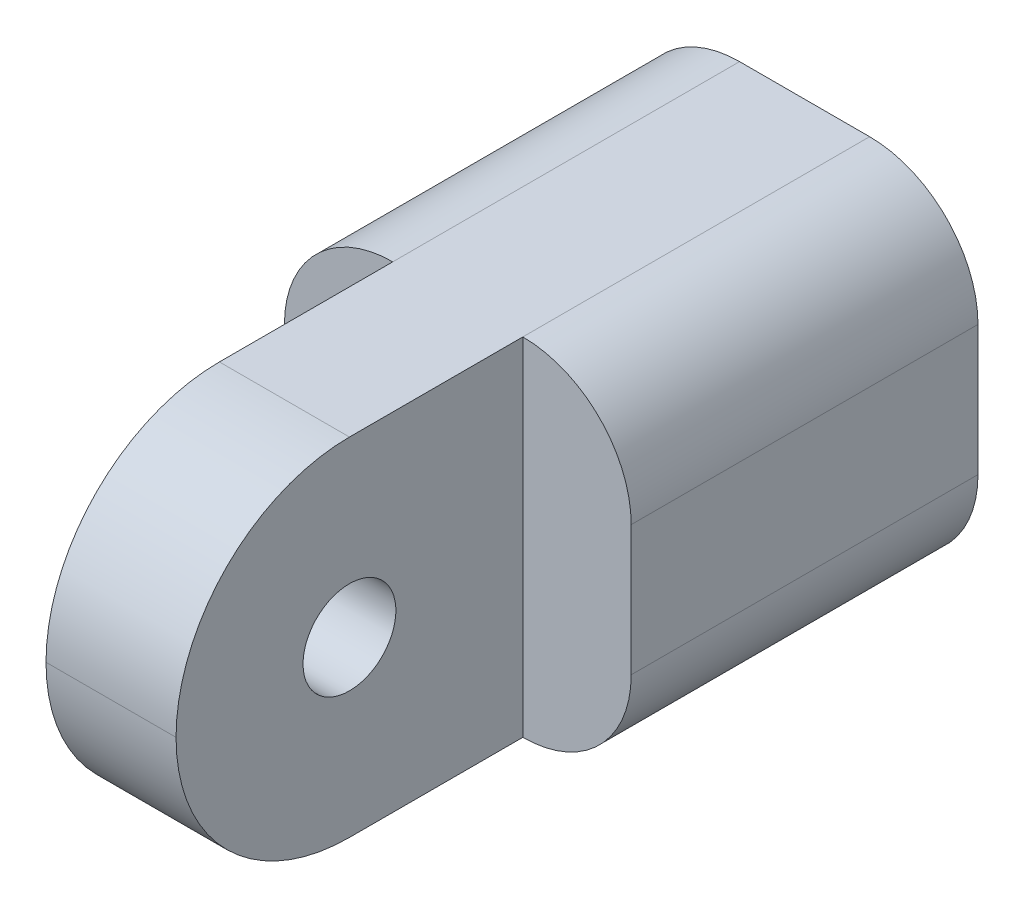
ISO-10303-21;
HEADER;
FILE_DESCRIPTION(('STEP AP214'),'2;1');
FILE_NAME('part.step','',(''),(''),'','','');
FILE_SCHEMA(('AUTOMOTIVE_DESIGN { 1 0 10303 214 1 1 1 1 }'));
ENDSEC;
DATA;
#1=APPLICATION_CONTEXT('core data for automotive mechanical design processes');
#2=APPLICATION_PROTOCOL_DEFINITION('international standard','automotive_design',2000,#1);
#3=PRODUCT_CONTEXT('',#1,'mechanical');
#4=PRODUCT('Part','Part','',(#3));
#5=PRODUCT_RELATED_PRODUCT_CATEGORY('part','',(#4));
#6=PRODUCT_DEFINITION_FORMATION('','',#4);
#7=PRODUCT_DEFINITION_CONTEXT('part definition',#1,'design');
#8=PRODUCT_DEFINITION('design','',#6,#7);
#9=PRODUCT_DEFINITION_SHAPE('','',#8);
#10=(LENGTH_UNIT() NAMED_UNIT(*) SI_UNIT(.MILLI.,.METRE.));
#11=(NAMED_UNIT(*) PLANE_ANGLE_UNIT() SI_UNIT($,.RADIAN.));
#12=(NAMED_UNIT(*) SI_UNIT($,.STERADIAN.) SOLID_ANGLE_UNIT());
#13=UNCERTAINTY_MEASURE_WITH_UNIT(LENGTH_MEASURE(1.E-05),#10,'distance_accuracy_value','');
#14=(GEOMETRIC_REPRESENTATION_CONTEXT(3) GLOBAL_UNCERTAINTY_ASSIGNED_CONTEXT((#13)) GLOBAL_UNIT_ASSIGNED_CONTEXT((#10,
#11,#12)) REPRESENTATION_CONTEXT('',''));
#15=CARTESIAN_POINT('',(0.,0.,0.));
#16=DIRECTION('',(0.,0.,1.));
#17=DIRECTION('',(1.,0.,0.));
#18=AXIS2_PLACEMENT_3D('',#15,#16,#17);
#19=CARTESIAN_POINT('',(-6.35,6.35,25.4));
#20=DIRECTION('',(1.,0.,0.));
#21=DIRECTION('',(0.,1.,0.));
#22=AXIS2_PLACEMENT_3D('',#19,#20,#21);
#23=PLANE('',#22);
#24=DIRECTION('',(0.,0.,-1.));
#25=VECTOR('',#24,1.);
#26=CARTESIAN_POINT('',(-6.35,-2.38125,25.4));
#27=LINE('',#26,#25);
#28=CARTESIAN_POINT('',(-6.35,-2.38125,0.));
#29=VERTEX_POINT('',#28);
#30=CARTESIAN_POINT('',(-6.35,-2.38125,12.7));
#31=VERTEX_POINT('',#30);
#32=EDGE_CURVE('E158',#29,#31,#27,.F.);
#33=ORIENTED_EDGE('',*,*,#32,.T.);
#34=DIRECTION('',(0.,1.,0.));
#35=VECTOR('',#34,1.);
#36=CARTESIAN_POINT('',(-6.35,-6.35,12.7));
#37=LINE('',#36,#35);
#38=CARTESIAN_POINT('',(-6.35,2.38125,12.7));
#39=VERTEX_POINT('',#38);
#40=EDGE_CURVE('E135',#31,#39,#37,.T.);
#41=ORIENTED_EDGE('',*,*,#40,.T.);
#42=DIRECTION('',(0.,0.,-1.));
#43=VECTOR('',#42,1.);
#44=CARTESIAN_POINT('',(-6.35,2.38125,25.4));
#45=LINE('',#44,#43);
#46=CARTESIAN_POINT('',(-6.35,2.38125,0.));
#47=VERTEX_POINT('',#46);
#48=EDGE_CURVE('E156',#39,#47,#45,.T.);
#49=ORIENTED_EDGE('',*,*,#48,.T.);
#50=DIRECTION('',(0.,-1.,0.));
#51=VECTOR('',#50,1.);
#52=CARTESIAN_POINT('',(-6.35,6.35,0.));
#53=LINE('',#52,#51);
#54=EDGE_CURVE('E212',#47,#29,#53,.T.);
#55=ORIENTED_EDGE('',*,*,#54,.T.);
#56=EDGE_LOOP('',(#33,#41,#49,#55));
#57=FACE_BOUND('',#56,.T.);
#58=ADVANCED_FACE('F33',(#57),#23,.F.);
#59=CARTESIAN_POINT('',(-6.35,-6.35,25.4));
#60=DIRECTION('',(0.,1.,0.));
#61=DIRECTION('',(0.,0.,1.));
#62=AXIS2_PLACEMENT_3D('',#59,#60,#61);
#63=PLANE('',#62);
#64=DIRECTION('',(0.,0.,1.));
#65=VECTOR('',#64,1.);
#66=CARTESIAN_POINT('',(2.38125,-6.35,25.4));
#67=LINE('',#66,#65);
#68=CARTESIAN_POINT('',(2.38125,-6.35,12.7));
#69=VERTEX_POINT('',#68);
#70=CARTESIAN_POINT('',(2.38125,-6.35,19.05));
#71=VERTEX_POINT('',#70);
#72=EDGE_CURVE('E182',#69,#71,#67,.T.);
#73=ORIENTED_EDGE('',*,*,#72,.T.);
#74=DIRECTION('',(1.,0.,0.));
#75=VECTOR('',#74,1.);
#76=CARTESIAN_POINT('',(-2.38125,-6.35,19.05));
#77=LINE('',#76,#75);
#78=CARTESIAN_POINT('',(-2.38125,-6.35,19.05));
#79=VERTEX_POINT('',#78);
#80=EDGE_CURVE('E125',#71,#79,#77,.F.);
#81=ORIENTED_EDGE('',*,*,#80,.T.);
#82=DIRECTION('',(0.,0.,-1.));
#83=VECTOR('',#82,1.);
#84=CARTESIAN_POINT('',(-2.38125,-6.35,25.4));
#85=LINE('',#84,#83);
#86=CARTESIAN_POINT('',(-2.38125,-6.35,12.7));
#87=VERTEX_POINT('',#86);
#88=EDGE_CURVE('E116',#79,#87,#85,.T.);
#89=ORIENTED_EDGE('',*,*,#88,.T.);
#90=CARTESIAN_POINT('',(-2.38125,-6.35,0.));
#91=VERTEX_POINT('',#90);
#92=EDGE_CURVE('E122',#87,#91,#85,.T.);
#93=ORIENTED_EDGE('',*,*,#92,.T.);
#94=DIRECTION('',(1.,0.,0.));
#95=VECTOR('',#94,1.);
#96=CARTESIAN_POINT('',(-6.35,-6.35,0.));
#97=LINE('',#96,#95);
#98=CARTESIAN_POINT('',(2.38125,-6.35,0.));
#99=VERTEX_POINT('',#98);
#100=EDGE_CURVE('E215',#91,#99,#97,.T.);
#101=ORIENTED_EDGE('',*,*,#100,.T.);
#102=DIRECTION('',(0.,0.,-1.));
#103=VECTOR('',#102,1.);
#104=CARTESIAN_POINT('',(2.38125,-6.35,25.4));
#105=LINE('',#104,#103);
#106=EDGE_CURVE('E127',#99,#69,#105,.F.);
#107=ORIENTED_EDGE('',*,*,#106,.T.);
#108=EDGE_LOOP('',(#73,#81,#89,#93,#101,#107));
#109=FACE_BOUND('',#108,.T.);
#110=ADVANCED_FACE('F119',(#109),#63,.F.);
#111=CARTESIAN_POINT('',(6.35,6.35,25.4));
#112=DIRECTION('',(-1.,0.,0.));
#113=DIRECTION('',(0.,-1.,0.));
#114=AXIS2_PLACEMENT_3D('',#111,#112,#113);
#115=PLANE('',#114);
#116=DIRECTION('',(0.,0.,-1.));
#117=VECTOR('',#116,1.);
#118=CARTESIAN_POINT('',(6.35,2.38125,25.4));
#119=LINE('',#118,#117);
#120=CARTESIAN_POINT('',(6.35,2.38125,0.));
#121=VERTEX_POINT('',#120);
#122=CARTESIAN_POINT('',(6.35,2.38125,12.7));
#123=VERTEX_POINT('',#122);
#124=EDGE_CURVE('E223',#121,#123,#119,.F.);
#125=ORIENTED_EDGE('',*,*,#124,.T.);
#126=DIRECTION('',(0.,1.,0.));
#127=VECTOR('',#126,1.);
#128=CARTESIAN_POINT('',(6.35,-6.35,12.7));
#129=LINE('',#128,#127);
#130=CARTESIAN_POINT('',(6.35,-2.38125,12.7));
#131=VERTEX_POINT('',#130);
#132=EDGE_CURVE('E190',#131,#123,#129,.T.);
#133=ORIENTED_EDGE('',*,*,#132,.F.);
#134=DIRECTION('',(0.,0.,-1.));
#135=VECTOR('',#134,1.);
#136=CARTESIAN_POINT('',(6.35,-2.38125,25.4));
#137=LINE('',#136,#135);
#138=CARTESIAN_POINT('',(6.35,-2.38125,0.));
#139=VERTEX_POINT('',#138);
#140=EDGE_CURVE('E226',#131,#139,#137,.T.);
#141=ORIENTED_EDGE('',*,*,#140,.T.);
#142=DIRECTION('',(0.,1.,0.));
#143=VECTOR('',#142,1.);
#144=CARTESIAN_POINT('',(6.35,6.35,0.));
#145=LINE('',#144,#143);
#146=EDGE_CURVE('E217',#139,#121,#145,.T.);
#147=ORIENTED_EDGE('',*,*,#146,.T.);
#148=EDGE_LOOP('',(#125,#133,#141,#147));
#149=FACE_BOUND('',#148,.T.);
#150=ADVANCED_FACE('F251',(#149),#115,.F.);
#151=CARTESIAN_POINT('',(-6.35,6.35,25.4));
#152=DIRECTION('',(0.,-1.,0.));
#153=DIRECTION('',(0.,0.,-1.));
#154=AXIS2_PLACEMENT_3D('',#151,#152,#153);
#155=PLANE('',#154);
#156=DIRECTION('',(0.,0.,-1.));
#157=VECTOR('',#156,1.);
#158=CARTESIAN_POINT('',(-2.38125,6.35,25.4));
#159=LINE('',#158,#157);
#160=CARTESIAN_POINT('',(-2.38125,6.35,12.7));
#161=VERTEX_POINT('',#160);
#162=CARTESIAN_POINT('',(-2.38125,6.35,19.05));
#163=VERTEX_POINT('',#162);
#164=EDGE_CURVE('E143',#161,#163,#159,.F.);
#165=ORIENTED_EDGE('',*,*,#164,.T.);
#166=DIRECTION('',(-1.,0.,0.));
#167=VECTOR('',#166,1.);
#168=CARTESIAN_POINT('',(2.38125,6.35,19.05));
#169=LINE('',#168,#167);
#170=CARTESIAN_POINT('',(2.38125,6.35,19.05));
#171=VERTEX_POINT('',#170);
#172=EDGE_CURVE('E11',#163,#171,#169,.F.);
#173=ORIENTED_EDGE('',*,*,#172,.T.);
#174=DIRECTION('',(0.,0.,-1.));
#175=VECTOR('',#174,1.);
#176=CARTESIAN_POINT('',(2.38125,6.35,25.4));
#177=LINE('',#176,#175);
#178=CARTESIAN_POINT('',(2.38125,6.35,12.7));
#179=VERTEX_POINT('',#178);
#180=EDGE_CURVE('E161',#171,#179,#177,.T.);
#181=ORIENTED_EDGE('',*,*,#180,.T.);
#182=CARTESIAN_POINT('',(2.38125,6.35,0.));
#183=VERTEX_POINT('',#182);
#184=EDGE_CURVE('E160',#179,#183,#177,.T.);
#185=ORIENTED_EDGE('',*,*,#184,.T.);
#186=DIRECTION('',(-1.,0.,0.));
#187=VECTOR('',#186,1.);
#188=CARTESIAN_POINT('',(-6.35,6.35,0.));
#189=LINE('',#188,#187);
#190=CARTESIAN_POINT('',(-2.38125,6.35,0.));
#191=VERTEX_POINT('',#190);
#192=EDGE_CURVE('E220',#183,#191,#189,.T.);
#193=ORIENTED_EDGE('',*,*,#192,.T.);
#194=EDGE_CURVE('E163',#191,#161,#159,.F.);
#195=ORIENTED_EDGE('',*,*,#194,.T.);
#196=EDGE_LOOP('',(#165,#173,#181,#185,#193,#195));
#197=FACE_BOUND('',#196,.T.);
#198=ADVANCED_FACE('F243',(#197),#155,.F.);
#199=CARTESIAN_POINT('',(0.,0.,0.));
#200=DIRECTION('',(0.,0.,1.));
#201=DIRECTION('',(1.,0.,0.));
#202=AXIS2_PLACEMENT_3D('',#199,#200,#201);
#203=PLANE('',#202);
#204=CARTESIAN_POINT('',(0.,0.,0.));
#205=DIRECTION('',(0.,0.,-1.));
#206=DIRECTION('',(-1.,0.,0.));
#207=AXIS2_PLACEMENT_3D('',#204,#205,#206);
#208=CIRCLE('',#207,3.39999999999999);
#209=CARTESIAN_POINT('',(-3.39999999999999,0.,0.));
#210=VERTEX_POINT('',#209);
#211=EDGE_CURVE('E139',#210,#210,#208,.T.);
#212=ORIENTED_EDGE('',*,*,#211,.F.);
#213=EDGE_LOOP('',(#212));
#214=FACE_BOUND('',#213,.T.);
#215=ORIENTED_EDGE('',*,*,#146,.F.);
#216=CARTESIAN_POINT('',(2.38125,-2.38125,0.));
#217=DIRECTION('',(0.,0.,1.));
#218=DIRECTION('',(1.,0.,0.));
#219=AXIS2_PLACEMENT_3D('',#216,#217,#218);
#220=CIRCLE('',#219,3.96875);
#221=EDGE_CURVE('E150',#139,#99,#220,.F.);
#222=ORIENTED_EDGE('',*,*,#221,.T.);
#223=ORIENTED_EDGE('',*,*,#100,.F.);
#224=CARTESIAN_POINT('',(-2.38125,-2.38125,0.));
#225=DIRECTION('',(0.,0.,1.));
#226=DIRECTION('',(1.,0.,0.));
#227=AXIS2_PLACEMENT_3D('',#224,#225,#226);
#228=CIRCLE('',#227,3.96875);
#229=EDGE_CURVE('E148',#91,#29,#228,.F.);
#230=ORIENTED_EDGE('',*,*,#229,.T.);
#231=ORIENTED_EDGE('',*,*,#54,.F.);
#232=CARTESIAN_POINT('',(-2.38125,2.38125,0.));
#233=DIRECTION('',(0.,0.,1.));
#234=DIRECTION('',(1.,0.,0.));
#235=AXIS2_PLACEMENT_3D('',#232,#233,#234);
#236=CIRCLE('',#235,3.96875);
#237=EDGE_CURVE('E230',#47,#191,#236,.F.);
#238=ORIENTED_EDGE('',*,*,#237,.T.);
#239=ORIENTED_EDGE('',*,*,#192,.F.);
#240=CARTESIAN_POINT('',(2.38125,2.38125,0.));
#241=DIRECTION('',(0.,0.,1.));
#242=DIRECTION('',(1.,0.,0.));
#243=AXIS2_PLACEMENT_3D('',#240,#241,#242);
#244=CIRCLE('',#243,3.96875);
#245=EDGE_CURVE('E228',#183,#121,#244,.F.);
#246=ORIENTED_EDGE('',*,*,#245,.T.);
#247=EDGE_LOOP('',(#215,#222,#223,#230,#231,#238,#239,#246));
#248=FACE_BOUND('',#247,.T.);
#249=ADVANCED_FACE('F234',(#214,#248),#203,.F.);
#250=CARTESIAN_POINT('',(2.38125,-2.38125,25.4));
#251=DIRECTION('',(0.,0.,-1.));
#252=DIRECTION('',(-1.,0.,0.));
#253=AXIS2_PLACEMENT_3D('',#250,#251,#252);
#254=CYLINDRICAL_SURFACE('',#253,3.96875);
#255=CARTESIAN_POINT('',(2.38125,-2.38125,12.7));
#256=DIRECTION('',(0.,0.,-1.));
#257=DIRECTION('',(-1.,0.,0.));
#258=AXIS2_PLACEMENT_3D('',#255,#256,#257);
#259=CIRCLE('',#258,3.96875);
#260=EDGE_CURVE('E140',#69,#131,#259,.F.);
#261=ORIENTED_EDGE('',*,*,#260,.F.);
#262=ORIENTED_EDGE('',*,*,#106,.F.);
#263=ORIENTED_EDGE('',*,*,#221,.F.);
#264=ORIENTED_EDGE('',*,*,#140,.F.);
#265=EDGE_LOOP('',(#261,#262,#263,#264));
#266=FACE_BOUND('',#265,.T.);
#267=ADVANCED_FACE('F256',(#266),#254,.T.);
#268=CARTESIAN_POINT('',(-2.38125,-2.38125,25.4));
#269=DIRECTION('',(0.,0.,-1.));
#270=DIRECTION('',(-1.,0.,0.));
#271=AXIS2_PLACEMENT_3D('',#268,#269,#270);
#272=CYLINDRICAL_SURFACE('',#271,3.96875);
#273=CARTESIAN_POINT('',(-2.38125,-2.38125,12.7));
#274=DIRECTION('',(0.,0.,-1.));
#275=DIRECTION('',(-1.,0.,0.));
#276=AXIS2_PLACEMENT_3D('',#273,#274,#275);
#277=CIRCLE('',#276,3.96875);
#278=EDGE_CURVE('E131',#31,#87,#277,.F.);
#279=ORIENTED_EDGE('',*,*,#278,.F.);
#280=ORIENTED_EDGE('',*,*,#32,.F.);
#281=ORIENTED_EDGE('',*,*,#229,.F.);
#282=ORIENTED_EDGE('',*,*,#92,.F.);
#283=EDGE_LOOP('',(#279,#280,#281,#282));
#284=FACE_BOUND('',#283,.T.);
#285=ADVANCED_FACE('F147',(#284),#272,.T.);
#286=CARTESIAN_POINT('',(-2.38125,2.38125,25.4));
#287=DIRECTION('',(0.,0.,-1.));
#288=DIRECTION('',(-1.,0.,0.));
#289=AXIS2_PLACEMENT_3D('',#286,#287,#288);
#290=CYLINDRICAL_SURFACE('',#289,3.96875);
#291=CARTESIAN_POINT('',(-2.38125,2.38125,12.7));
#292=DIRECTION('',(0.,0.,-1.));
#293=DIRECTION('',(-1.,0.,0.));
#294=AXIS2_PLACEMENT_3D('',#291,#292,#293);
#295=CIRCLE('',#294,3.96875);
#296=EDGE_CURVE('E169',#161,#39,#295,.F.);
#297=ORIENTED_EDGE('',*,*,#296,.F.);
#298=ORIENTED_EDGE('',*,*,#194,.F.);
#299=ORIENTED_EDGE('',*,*,#237,.F.);
#300=ORIENTED_EDGE('',*,*,#48,.F.);
#301=EDGE_LOOP('',(#297,#298,#299,#300));
#302=FACE_BOUND('',#301,.T.);
#303=ADVANCED_FACE('F240',(#302),#290,.T.);
#304=CARTESIAN_POINT('',(2.38125,2.38125,25.4));
#305=DIRECTION('',(0.,0.,-1.));
#306=DIRECTION('',(-1.,0.,0.));
#307=AXIS2_PLACEMENT_3D('',#304,#305,#306);
#308=CYLINDRICAL_SURFACE('',#307,3.96875);
#309=CARTESIAN_POINT('',(2.38125,2.38125,12.7));
#310=DIRECTION('',(0.,0.,-1.));
#311=DIRECTION('',(-1.,0.,0.));
#312=AXIS2_PLACEMENT_3D('',#309,#310,#311);
#313=CIRCLE('',#312,3.96875);
#314=EDGE_CURVE('E166',#123,#179,#313,.F.);
#315=ORIENTED_EDGE('',*,*,#314,.F.);
#316=ORIENTED_EDGE('',*,*,#124,.F.);
#317=ORIENTED_EDGE('',*,*,#245,.F.);
#318=ORIENTED_EDGE('',*,*,#184,.F.);
#319=EDGE_LOOP('',(#315,#316,#317,#318));
#320=FACE_BOUND('',#319,.T.);
#321=ADVANCED_FACE('F249',(#320),#308,.T.);
#322=CARTESIAN_POINT('',(0.,0.,10.));
#323=DIRECTION('',(0.,0.,-1.));
#324=DIRECTION('',(-1.,0.,0.));
#325=AXIS2_PLACEMENT_3D('',#322,#323,#324);
#326=CONICAL_SURFACE('',#325,3.4,1.02974425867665);
#327=CARTESIAN_POINT('',(0.,0.,12.0429261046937));
#328=VERTEX_POINT('',#327);
#329=VERTEX_LOOP('',#328);
#330=FACE_BOUND('',#329,.T.);
#331=CARTESIAN_POINT('',(0.,0.,10.));
#332=DIRECTION('',(0.,0.,-1.));
#333=DIRECTION('',(-1.,0.,0.));
#334=AXIS2_PLACEMENT_3D('',#331,#332,#333);
#335=CIRCLE('',#334,3.4);
#336=CARTESIAN_POINT('',(-3.4,0.,10.));
#337=VERTEX_POINT('',#336);
#338=EDGE_CURVE('E209',#337,#337,#335,.T.);
#339=ORIENTED_EDGE('',*,*,#338,.T.);
#340=EDGE_LOOP('',(#339));
#341=FACE_BOUND('',#340,.T.);
#342=ADVANCED_FACE('F282',(#330,#341),#326,.F.);
#343=CARTESIAN_POINT('',(0.,0.,0.));
#344=DIRECTION('',(0.,0.,-1.));
#345=DIRECTION('',(-1.,0.,0.));
#346=AXIS2_PLACEMENT_3D('',#343,#344,#345);
#347=CYLINDRICAL_SURFACE('',#346,3.39999999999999);
#348=ORIENTED_EDGE('',*,*,#338,.F.);
#349=EDGE_LOOP('',(#348));
#350=FACE_BOUND('',#349,.T.);
#351=ORIENTED_EDGE('',*,*,#211,.T.);
#352=EDGE_LOOP('',(#351));
#353=FACE_BOUND('',#352,.T.);
#354=ADVANCED_FACE('F286',(#350,#353),#347,.F.);
#355=CARTESIAN_POINT('',(2.38125,-6.35,25.4));
#356=DIRECTION('',(-1.,0.,0.));
#357=DIRECTION('',(0.,0.,1.));
#358=AXIS2_PLACEMENT_3D('',#355,#356,#357);
#359=PLANE('',#358);
#360=CARTESIAN_POINT('',(2.38125,0.,19.05));
#361=DIRECTION('',(-1.,0.,0.));
#362=DIRECTION('',(0.,0.,1.));
#363=AXIS2_PLACEMENT_3D('',#360,#361,#362);
#364=CIRCLE('',#363,1.69999999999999);
#365=CARTESIAN_POINT('',(2.38125,0.,20.75));
#366=VERTEX_POINT('',#365);
#367=EDGE_CURVE('E194',#366,#366,#364,.T.);
#368=ORIENTED_EDGE('',*,*,#367,.T.);
#369=EDGE_LOOP('',(#368));
#370=FACE_BOUND('',#369,.T.);
#371=CARTESIAN_POINT('',(2.38125,0.,19.05));
#372=DIRECTION('',(-1.,0.,0.));
#373=DIRECTION('',(0.,0.,1.));
#374=AXIS2_PLACEMENT_3D('',#371,#372,#373);
#375=CIRCLE('',#374,6.35);
#376=CARTESIAN_POINT('',(2.38125,0.,25.4));
#377=VERTEX_POINT('',#376);
#378=EDGE_CURVE('E171',#171,#377,#375,.F.);
#379=ORIENTED_EDGE('',*,*,#378,.T.);
#380=CARTESIAN_POINT('',(2.38125,0.,19.05));
#381=DIRECTION('',(-1.,0.,0.));
#382=DIRECTION('',(0.,0.,1.));
#383=AXIS2_PLACEMENT_3D('',#380,#381,#382);
#384=CIRCLE('',#383,6.35);
#385=EDGE_CURVE('E173',#377,#71,#384,.F.);
#386=ORIENTED_EDGE('',*,*,#385,.T.);
#387=ORIENTED_EDGE('',*,*,#72,.F.);
#388=DIRECTION('',(0.,1.,0.));
#389=VECTOR('',#388,1.);
#390=CARTESIAN_POINT('',(2.38125,-6.35,12.7));
#391=LINE('',#390,#389);
#392=EDGE_CURVE('E145',#69,#179,#391,.T.);
#393=ORIENTED_EDGE('',*,*,#392,.T.);
#394=ORIENTED_EDGE('',*,*,#180,.F.);
#395=EDGE_LOOP('',(#379,#386,#387,#393,#394));
#396=FACE_BOUND('',#395,.T.);
#397=ADVANCED_FACE('F180',(#370,#396),#359,.F.);
#398=CARTESIAN_POINT('',(2.38125,-6.35,12.7));
#399=DIRECTION('',(0.,0.,-1.));
#400=DIRECTION('',(-1.,0.,0.));
#401=AXIS2_PLACEMENT_3D('',#398,#399,#400);
#402=PLANE('',#401);
#403=ORIENTED_EDGE('',*,*,#260,.T.);
#404=ORIENTED_EDGE('',*,*,#132,.T.);
#405=ORIENTED_EDGE('',*,*,#314,.T.);
#406=ORIENTED_EDGE('',*,*,#392,.F.);
#407=EDGE_LOOP('',(#403,#404,#405,#406));
#408=FACE_BOUND('',#407,.T.);
#409=ADVANCED_FACE('F258',(#408),#402,.F.);
#410=CARTESIAN_POINT('',(-2.38125,-6.35,25.4));
#411=DIRECTION('',(1.,0.,0.));
#412=DIRECTION('',(0.,0.,-1.));
#413=AXIS2_PLACEMENT_3D('',#410,#411,#412);
#414=PLANE('',#413);
#415=CARTESIAN_POINT('',(-2.38125,0.,19.05));
#416=DIRECTION('',(-1.,0.,0.));
#417=DIRECTION('',(0.,0.,1.));
#418=AXIS2_PLACEMENT_3D('',#415,#416,#417);
#419=CIRCLE('',#418,1.69999999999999);
#420=CARTESIAN_POINT('',(-2.38125,0.,20.75));
#421=VERTEX_POINT('',#420);
#422=EDGE_CURVE('E196',#421,#421,#419,.T.);
#423=ORIENTED_EDGE('',*,*,#422,.F.);
#424=EDGE_LOOP('',(#423));
#425=FACE_BOUND('',#424,.T.);
#426=ORIENTED_EDGE('',*,*,#88,.F.);
#427=CARTESIAN_POINT('',(-2.38125,0.,19.05));
#428=DIRECTION('',(1.,0.,0.));
#429=DIRECTION('',(0.,0.,-1.));
#430=AXIS2_PLACEMENT_3D('',#427,#428,#429);
#431=CIRCLE('',#430,6.35);
#432=CARTESIAN_POINT('',(-2.38125,0.,25.4));
#433=VERTEX_POINT('',#432);
#434=EDGE_CURVE('E42',#79,#433,#431,.F.);
#435=ORIENTED_EDGE('',*,*,#434,.T.);
#436=CARTESIAN_POINT('',(-2.38125,0.,19.05));
#437=DIRECTION('',(1.,0.,0.));
#438=DIRECTION('',(0.,0.,-1.));
#439=AXIS2_PLACEMENT_3D('',#436,#437,#438);
#440=CIRCLE('',#439,6.35);
#441=EDGE_CURVE('E52',#433,#163,#440,.F.);
#442=ORIENTED_EDGE('',*,*,#441,.T.);
#443=ORIENTED_EDGE('',*,*,#164,.F.);
#444=DIRECTION('',(0.,1.,0.));
#445=VECTOR('',#444,1.);
#446=CARTESIAN_POINT('',(-2.38125,-6.35,12.7));
#447=LINE('',#446,#445);
#448=EDGE_CURVE('E133',#87,#161,#447,.T.);
#449=ORIENTED_EDGE('',*,*,#448,.F.);
#450=EDGE_LOOP('',(#426,#435,#442,#443,#449));
#451=FACE_BOUND('',#450,.T.);
#452=ADVANCED_FACE('F142',(#425,#451),#414,.F.);
#453=CARTESIAN_POINT('',(-2.38125,-6.35,12.7));
#454=DIRECTION('',(0.,0.,-1.));
#455=DIRECTION('',(-1.,0.,0.));
#456=AXIS2_PLACEMENT_3D('',#453,#454,#455);
#457=PLANE('',#456);
#458=ORIENTED_EDGE('',*,*,#278,.T.);
#459=ORIENTED_EDGE('',*,*,#448,.T.);
#460=ORIENTED_EDGE('',*,*,#296,.T.);
#461=ORIENTED_EDGE('',*,*,#40,.F.);
#462=EDGE_LOOP('',(#458,#459,#460,#461));
#463=FACE_BOUND('',#462,.T.);
#464=ADVANCED_FACE('F132',(#463),#457,.F.);
#465=CARTESIAN_POINT('',(0.,0.,19.05));
#466=DIRECTION('',(1.,0.,0.));
#467=DIRECTION('',(0.,0.,-1.));
#468=AXIS2_PLACEMENT_3D('',#465,#466,#467);
#469=CYLINDRICAL_SURFACE('',#468,6.35);
#470=ORIENTED_EDGE('',*,*,#172,.F.);
#471=ORIENTED_EDGE('',*,*,#441,.F.);
#472=DIRECTION('',(-1.,0.,0.));
#473=VECTOR('',#472,1.);
#474=CARTESIAN_POINT('',(-2.38125,0.,25.4));
#475=LINE('',#474,#473);
#476=EDGE_CURVE('E37',#377,#433,#475,.T.);
#477=ORIENTED_EDGE('',*,*,#476,.F.);
#478=ORIENTED_EDGE('',*,*,#378,.F.);
#479=EDGE_LOOP('',(#470,#471,#477,#478));
#480=FACE_BOUND('',#479,.T.);
#481=ADVANCED_FACE('F35',(#480),#469,.T.);
#482=CARTESIAN_POINT('',(0.,0.,19.05));
#483=DIRECTION('',(-1.,0.,0.));
#484=DIRECTION('',(0.,0.,1.));
#485=AXIS2_PLACEMENT_3D('',#482,#483,#484);
#486=CYLINDRICAL_SURFACE('',#485,6.35);
#487=ORIENTED_EDGE('',*,*,#434,.F.);
#488=ORIENTED_EDGE('',*,*,#80,.F.);
#489=ORIENTED_EDGE('',*,*,#385,.F.);
#490=ORIENTED_EDGE('',*,*,#476,.T.);
#491=EDGE_LOOP('',(#487,#488,#489,#490));
#492=FACE_BOUND('',#491,.T.);
#493=ADVANCED_FACE('F192',(#492),#486,.T.);
#494=CARTESIAN_POINT('',(-2.38125,0.,19.05));
#495=DIRECTION('',(-1.,0.,0.));
#496=DIRECTION('',(0.,0.,1.));
#497=AXIS2_PLACEMENT_3D('',#494,#495,#496);
#498=CYLINDRICAL_SURFACE('',#497,1.69999999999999);
#499=ORIENTED_EDGE('',*,*,#422,.T.);
#500=EDGE_LOOP('',(#499));
#501=FACE_BOUND('',#500,.T.);
#502=ORIENTED_EDGE('',*,*,#367,.F.);
#503=EDGE_LOOP('',(#502));
#504=FACE_BOUND('',#503,.T.);
#505=ADVANCED_FACE('F265',(#501,#504),#498,.F.);
#506=CLOSED_SHELL('',(#58,#110,#150,#198,#249,#267,#285,#303,#321,#342,#354,#397,#409,#452,#464,
#481,#493,#505));
#507=MANIFOLD_SOLID_BREP('B2',#506);
#508=ADVANCED_BREP_SHAPE_REPRESENTATION('',(#18,#507),#14);
#509=SHAPE_DEFINITION_REPRESENTATION(#9,#508);
ENDSEC;
END-ISO-10303-21;
